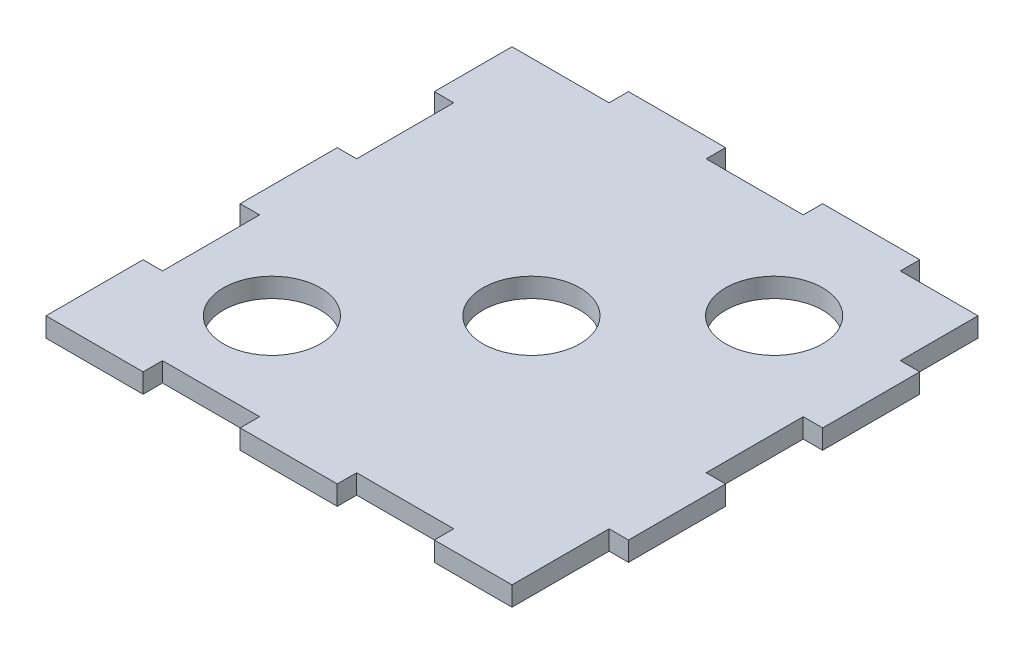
from build123d import *

# Parameters (mm, degrees)
SKETCH2_R           = 10
BOSS_EXTRUDE1_DEPTH = 4


with BuildPart() as part:
    # Sketch2 → Boss-Extrude1 (new body)
    with BuildSketch(Plane(origin=(0, 0, 0), x_dir=(1, 0, 0), z_dir=(0, 1, 0))):
        Polygon((-50, 46), (-30, 46), (-30, 50), (-10, 50), (-10, 46), (10, 46), (10, 50), (30, 50), (30, 46), (46, 46), (46, 30), (50, 30), (50, 10), (46, 10), (46, -10), (50, -10), (50, -30), (46, -30), (46, -50), (30, -50), (30, -46), (10, -46), (10, -50), (-10, -50), (-10, -46), (-30, -46), (-30, -50), (-50, -50), (-50, -30), (-46, -30), (-46, -10), (-50, -10), (-50, 10), (-46, 10), (-46, 30), (-50, 30), align=None)
        with Locations(Location((0, 0, 0), (0, 0, 270))):
            Circle(SKETCH2_R, mode=Mode.SUBTRACT)
        with Locations(Location((25, 25, 0), (0, 0, 270))):
            Circle(SKETCH2_R, mode=Mode.SUBTRACT)
        with Locations(Location((-26.732086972, -26.732086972, 0), (0, 0, 270))):
            Circle(SKETCH2_R, mode=Mode.SUBTRACT)
    extrude(amount=BOSS_EXTRUDE1_DEPTH)


solid = part.part
